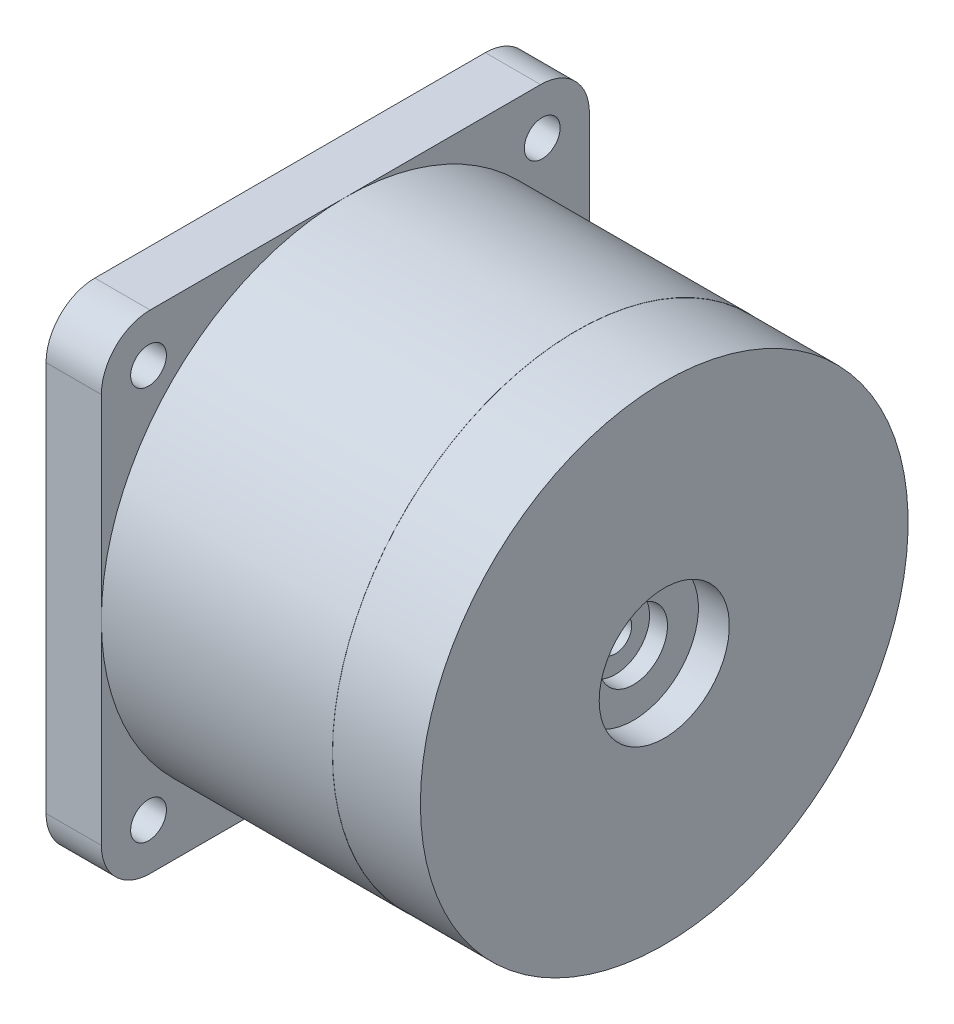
ISO-10303-21;
HEADER;
FILE_DESCRIPTION(('STEP AP214'),'2;1');
FILE_NAME('part.step','',(''),(''),'','','');
FILE_SCHEMA(('AUTOMOTIVE_DESIGN { 1 0 10303 214 1 1 1 1 }'));
ENDSEC;
DATA;
#1=APPLICATION_CONTEXT('core data for automotive mechanical design processes');
#2=APPLICATION_PROTOCOL_DEFINITION('international standard','automotive_design',2000,#1);
#3=PRODUCT_CONTEXT('',#1,'mechanical');
#4=PRODUCT('Part','Part','',(#3));
#5=PRODUCT_RELATED_PRODUCT_CATEGORY('part','',(#4));
#6=PRODUCT_DEFINITION_FORMATION('','',#4);
#7=PRODUCT_DEFINITION_CONTEXT('part definition',#1,'design');
#8=PRODUCT_DEFINITION('design','',#6,#7);
#9=PRODUCT_DEFINITION_SHAPE('','',#8);
#10=(LENGTH_UNIT() NAMED_UNIT(*) SI_UNIT(.MILLI.,.METRE.));
#11=(NAMED_UNIT(*) PLANE_ANGLE_UNIT() SI_UNIT($,.RADIAN.));
#12=(NAMED_UNIT(*) SI_UNIT($,.STERADIAN.) SOLID_ANGLE_UNIT());
#13=UNCERTAINTY_MEASURE_WITH_UNIT(LENGTH_MEASURE(1.E-05),#10,'distance_accuracy_value','');
#14=(GEOMETRIC_REPRESENTATION_CONTEXT(3) GLOBAL_UNCERTAINTY_ASSIGNED_CONTEXT((#13)) GLOBAL_UNIT_ASSIGNED_CONTEXT((#10,
#11,#12)) REPRESENTATION_CONTEXT('',''));
#15=CARTESIAN_POINT('',(0.,0.,0.));
#16=DIRECTION('',(0.,0.,1.));
#17=DIRECTION('',(1.,0.,0.));
#18=AXIS2_PLACEMENT_3D('',#15,#16,#17);
#19=CARTESIAN_POINT('',(0.,0.,0.));
#20=DIRECTION('',(-1.,0.,0.));
#21=DIRECTION('',(0.,0.,1.));
#22=AXIS2_PLACEMENT_3D('',#19,#20,#21);
#23=PLANE('',#22);
#24=CARTESIAN_POINT('',(0.,0.,0.));
#25=DIRECTION('',(-1.,0.,0.));
#26=DIRECTION('',(0.,0.,1.));
#27=AXIS2_PLACEMENT_3D('',#24,#25,#26);
#28=CIRCLE('',#27,14.99);
#29=CARTESIAN_POINT('',(0.,0.,14.99));
#30=VERTEX_POINT('',#29);
#31=EDGE_CURVE('E162',#30,#30,#28,.T.);
#32=ORIENTED_EDGE('',*,*,#31,.F.);
#33=EDGE_LOOP('',(#32));
#34=FACE_BOUND('',#33,.T.);
#35=CARTESIAN_POINT('',(0.,0.,0.));
#36=DIRECTION('',(-1.,0.,0.));
#37=DIRECTION('',(0.,0.,1.));
#38=AXIS2_PLACEMENT_3D('',#35,#36,#37);
#39=CIRCLE('',#38,4.);
#40=CARTESIAN_POINT('',(0.,0.,4.));
#41=VERTEX_POINT('',#40);
#42=EDGE_CURVE('E261',#41,#41,#39,.T.);
#43=ORIENTED_EDGE('',*,*,#42,.T.);
#44=EDGE_LOOP('',(#43));
#45=FACE_BOUND('',#44,.T.);
#46=ADVANCED_FACE('F34',(#34,#45),#23,.F.);
#47=CARTESIAN_POINT('',(-21.4,0.,0.));
#48=DIRECTION('',(-1.,0.,0.));
#49=DIRECTION('',(0.,0.,1.));
#50=AXIS2_PLACEMENT_3D('',#47,#48,#49);
#51=PLANE('',#50);
#52=CARTESIAN_POINT('',(-21.4,0.,0.));
#53=DIRECTION('',(-1.,0.,0.));
#54=DIRECTION('',(0.,0.,1.));
#55=AXIS2_PLACEMENT_3D('',#52,#53,#54);
#56=CIRCLE('',#55,13.5);
#57=CARTESIAN_POINT('',(-21.4,0.,13.5));
#58=VERTEX_POINT('',#57);
#59=EDGE_CURVE('E249',#58,#58,#56,.T.);
#60=ORIENTED_EDGE('',*,*,#59,.T.);
#61=EDGE_LOOP('',(#60));
#62=FACE_BOUND('',#61,.T.);
#63=CARTESIAN_POINT('',(-21.4,-4.9,0.));
#64=DIRECTION('',(-1.,0.,0.));
#65=DIRECTION('',(0.,0.,1.));
#66=AXIS2_PLACEMENT_3D('',#63,#64,#65);
#67=CIRCLE('',#66,5.);
#68=CARTESIAN_POINT('',(-21.4,-4.9,-5.));
#69=VERTEX_POINT('',#68);
#70=EDGE_CURVE('E258',#69,#69,#67,.T.);
#71=ORIENTED_EDGE('',*,*,#70,.F.);
#72=EDGE_LOOP('',(#71));
#73=FACE_BOUND('',#72,.T.);
#74=ADVANCED_FACE('F310',(#62,#73),#51,.T.);
#75=CARTESIAN_POINT('',(0.,0.,0.));
#76=DIRECTION('',(-1.,0.,0.));
#77=DIRECTION('',(0.,0.,1.));
#78=AXIS2_PLACEMENT_3D('',#75,#76,#77);
#79=CYLINDRICAL_SURFACE('',#78,14.99);
#80=CARTESIAN_POINT('',(-5.4,0.,0.));
#81=DIRECTION('',(-1.,0.,0.));
#82=DIRECTION('',(0.,0.,1.));
#83=AXIS2_PLACEMENT_3D('',#80,#81,#82);
#84=CIRCLE('',#83,14.99);
#85=CARTESIAN_POINT('',(-5.4,0.,14.99));
#86=VERTEX_POINT('',#85);
#87=EDGE_CURVE('E159',#86,#86,#84,.T.);
#88=ORIENTED_EDGE('',*,*,#87,.F.);
#89=EDGE_LOOP('',(#88));
#90=FACE_BOUND('',#89,.T.);
#91=ORIENTED_EDGE('',*,*,#31,.T.);
#92=EDGE_LOOP('',(#91));
#93=FACE_BOUND('',#92,.T.);
#94=ADVANCED_FACE('F312',(#90,#93),#79,.T.);
#95=CARTESIAN_POINT('',(-5.4,14.99,0.));
#96=DIRECTION('',(-1.,0.,0.));
#97=DIRECTION('',(0.,0.,1.));
#98=AXIS2_PLACEMENT_3D('',#95,#96,#97);
#99=PLANE('',#98);
#100=CARTESIAN_POINT('',(-5.4,0.,0.));
#101=DIRECTION('',(-1.,0.,0.));
#102=DIRECTION('',(0.,0.,1.));
#103=AXIS2_PLACEMENT_3D('',#100,#101,#102);
#104=CIRCLE('',#103,15.);
#105=CARTESIAN_POINT('',(-5.4,0.,15.));
#106=VERTEX_POINT('',#105);
#107=EDGE_CURVE('E140',#106,#106,#104,.T.);
#108=ORIENTED_EDGE('',*,*,#107,.F.);
#109=EDGE_LOOP('',(#108));
#110=FACE_BOUND('',#109,.T.);
#111=ORIENTED_EDGE('',*,*,#87,.T.);
#112=EDGE_LOOP('',(#111));
#113=FACE_BOUND('',#112,.T.);
#114=ADVANCED_FACE('F319',(#110,#113),#99,.F.);
#115=CARTESIAN_POINT('',(0.,0.,0.));
#116=DIRECTION('',(-1.,0.,0.));
#117=DIRECTION('',(0.,0.,1.));
#118=AXIS2_PLACEMENT_3D('',#115,#116,#117);
#119=CYLINDRICAL_SURFACE('',#118,15.);
#120=CARTESIAN_POINT('',(-19.6,0.,0.));
#121=DIRECTION('',(-1.,0.,0.));
#122=DIRECTION('',(0.,0.,1.));
#123=AXIS2_PLACEMENT_3D('',#120,#121,#122);
#124=CIRCLE('',#123,15.);
#125=CARTESIAN_POINT('',(-19.6,0.,15.));
#126=VERTEX_POINT('',#125);
#127=CARTESIAN_POINT('',(-19.6,15.,0.));
#128=VERTEX_POINT('',#127);
#129=EDGE_CURVE('E129',#126,#128,#124,.T.);
#130=ORIENTED_EDGE('',*,*,#129,.F.);
#131=CARTESIAN_POINT('',(-19.6,-15.,0.));
#132=VERTEX_POINT('',#131);
#133=EDGE_CURVE('E133',#132,#126,#124,.T.);
#134=ORIENTED_EDGE('',*,*,#133,.F.);
#135=CARTESIAN_POINT('',(-19.6,0.,-15.));
#136=VERTEX_POINT('',#135);
#137=EDGE_CURVE('E146',#136,#132,#124,.T.);
#138=ORIENTED_EDGE('',*,*,#137,.F.);
#139=EDGE_CURVE('E136',#128,#136,#124,.T.);
#140=ORIENTED_EDGE('',*,*,#139,.F.);
#141=EDGE_LOOP('',(#130,#134,#138,#140));
#142=FACE_BOUND('',#141,.T.);
#143=ORIENTED_EDGE('',*,*,#107,.T.);
#144=EDGE_LOOP('',(#143));
#145=FACE_BOUND('',#144,.T.);
#146=ADVANCED_FACE('F130',(#142,#145),#119,.T.);
#147=CARTESIAN_POINT('',(-19.6,-15.,-15.));
#148=DIRECTION('',(-1.,0.,0.));
#149=DIRECTION('',(0.,0.,1.));
#150=AXIS2_PLACEMENT_3D('',#147,#148,#149);
#151=PLANE('',#150);
#152=CARTESIAN_POINT('',(-19.6,12.1,12.1));
#153=DIRECTION('',(-1.,0.,0.));
#154=DIRECTION('',(0.,0.,1.));
#155=AXIS2_PLACEMENT_3D('',#152,#153,#154);
#156=CIRCLE('',#155,1.1);
#157=CARTESIAN_POINT('',(-19.6,12.1,13.2));
#158=VERTEX_POINT('',#157);
#159=EDGE_CURVE('E234',#158,#158,#156,.T.);
#160=ORIENTED_EDGE('',*,*,#159,.T.);
#161=EDGE_LOOP('',(#160));
#162=FACE_BOUND('',#161,.T.);
#163=DIRECTION('',(0.,0.,-1.));
#164=VECTOR('',#163,1.);
#165=CARTESIAN_POINT('',(-19.6,15.,-15.));
#166=LINE('',#165,#164);
#167=CARTESIAN_POINT('',(-19.6,15.,12.));
#168=VERTEX_POINT('',#167);
#169=EDGE_CURVE('E154',#168,#128,#166,.T.);
#170=ORIENTED_EDGE('',*,*,#169,.F.);
#171=CARTESIAN_POINT('',(-19.6,12.,12.));
#172=DIRECTION('',(-1.,0.,0.));
#173=DIRECTION('',(0.,0.,1.));
#174=AXIS2_PLACEMENT_3D('',#171,#172,#173);
#175=CIRCLE('',#174,3.);
#176=CARTESIAN_POINT('',(-19.6,12.,15.));
#177=VERTEX_POINT('',#176);
#178=EDGE_CURVE('E149',#168,#177,#175,.F.);
#179=ORIENTED_EDGE('',*,*,#178,.T.);
#180=DIRECTION('',(0.,1.,0.));
#181=VECTOR('',#180,1.);
#182=CARTESIAN_POINT('',(-19.6,15.,15.));
#183=LINE('',#182,#181);
#184=EDGE_CURVE('E116',#126,#177,#183,.T.);
#185=ORIENTED_EDGE('',*,*,#184,.F.);
#186=ORIENTED_EDGE('',*,*,#129,.T.);
#187=EDGE_LOOP('',(#170,#179,#185,#186));
#188=FACE_BOUND('',#187,.T.);
#189=ADVANCED_FACE('F148',(#162,#188),#151,.F.);
#190=CARTESIAN_POINT('',(-19.6,12.1,-12.1));
#191=DIRECTION('',(-1.,0.,0.));
#192=DIRECTION('',(0.,0.,1.));
#193=AXIS2_PLACEMENT_3D('',#190,#191,#192);
#194=CIRCLE('',#193,1.1);
#195=CARTESIAN_POINT('',(-19.6,12.1,-11.));
#196=VERTEX_POINT('',#195);
#197=EDGE_CURVE('E228',#196,#196,#194,.T.);
#198=ORIENTED_EDGE('',*,*,#197,.T.);
#199=EDGE_LOOP('',(#198));
#200=FACE_BOUND('',#199,.T.);
#201=DIRECTION('',(0.,-1.,0.));
#202=VECTOR('',#201,1.);
#203=CARTESIAN_POINT('',(-19.6,15.,-15.));
#204=LINE('',#203,#202);
#205=CARTESIAN_POINT('',(-19.6,12.,-15.));
#206=VERTEX_POINT('',#205);
#207=EDGE_CURVE('E217',#206,#136,#204,.T.);
#208=ORIENTED_EDGE('',*,*,#207,.F.);
#209=CARTESIAN_POINT('',(-19.6,12.,-12.));
#210=DIRECTION('',(-1.,0.,0.));
#211=DIRECTION('',(0.,0.,1.));
#212=AXIS2_PLACEMENT_3D('',#209,#210,#211);
#213=CIRCLE('',#212,3.);
#214=CARTESIAN_POINT('',(-19.6,15.,-12.));
#215=VERTEX_POINT('',#214);
#216=EDGE_CURVE('E11',#206,#215,#213,.F.);
#217=ORIENTED_EDGE('',*,*,#216,.T.);
#218=EDGE_CURVE('E123',#128,#215,#166,.T.);
#219=ORIENTED_EDGE('',*,*,#218,.F.);
#220=ORIENTED_EDGE('',*,*,#139,.T.);
#221=EDGE_LOOP('',(#208,#217,#219,#220));
#222=FACE_BOUND('',#221,.T.);
#223=ADVANCED_FACE('F216',(#200,#222),#151,.F.);
#224=CARTESIAN_POINT('',(-19.6,-12.1,-12.1));
#225=DIRECTION('',(-1.,0.,0.));
#226=DIRECTION('',(0.,0.,1.));
#227=AXIS2_PLACEMENT_3D('',#224,#225,#226);
#228=CIRCLE('',#227,1.1);
#229=CARTESIAN_POINT('',(-19.6,-12.1,-11.));
#230=VERTEX_POINT('',#229);
#231=EDGE_CURVE('E240',#230,#230,#228,.T.);
#232=ORIENTED_EDGE('',*,*,#231,.T.);
#233=EDGE_LOOP('',(#232));
#234=FACE_BOUND('',#233,.T.);
#235=DIRECTION('',(0.,0.,1.));
#236=VECTOR('',#235,1.);
#237=CARTESIAN_POINT('',(-19.6,-15.,-15.));
#238=LINE('',#237,#236);
#239=CARTESIAN_POINT('',(-19.6,-15.,-12.));
#240=VERTEX_POINT('',#239);
#241=EDGE_CURVE('E150',#240,#132,#238,.T.);
#242=ORIENTED_EDGE('',*,*,#241,.F.);
#243=CARTESIAN_POINT('',(-19.6,-12.,-12.));
#244=DIRECTION('',(-1.,0.,0.));
#245=DIRECTION('',(0.,0.,1.));
#246=AXIS2_PLACEMENT_3D('',#243,#244,#245);
#247=CIRCLE('',#246,3.);
#248=CARTESIAN_POINT('',(-19.6,-12.,-15.));
#249=VERTEX_POINT('',#248);
#250=EDGE_CURVE('E55',#240,#249,#247,.F.);
#251=ORIENTED_EDGE('',*,*,#250,.T.);
#252=EDGE_CURVE('E196',#136,#249,#204,.T.);
#253=ORIENTED_EDGE('',*,*,#252,.F.);
#254=ORIENTED_EDGE('',*,*,#137,.T.);
#255=EDGE_LOOP('',(#242,#251,#253,#254));
#256=FACE_BOUND('',#255,.T.);
#257=ADVANCED_FACE('F213',(#234,#256),#151,.F.);
#258=CARTESIAN_POINT('',(-19.6,-12.1,12.1));
#259=DIRECTION('',(-1.,0.,0.));
#260=DIRECTION('',(0.,0.,1.));
#261=AXIS2_PLACEMENT_3D('',#258,#259,#260);
#262=CIRCLE('',#261,1.1);
#263=CARTESIAN_POINT('',(-19.6,-12.1,13.2));
#264=VERTEX_POINT('',#263);
#265=EDGE_CURVE('E246',#264,#264,#262,.T.);
#266=ORIENTED_EDGE('',*,*,#265,.T.);
#267=EDGE_LOOP('',(#266));
#268=FACE_BOUND('',#267,.T.);
#269=CARTESIAN_POINT('',(-19.6,-12.,15.));
#270=VERTEX_POINT('',#269);
#271=EDGE_CURVE('E112',#270,#126,#183,.T.);
#272=ORIENTED_EDGE('',*,*,#271,.F.);
#273=CARTESIAN_POINT('',(-19.6,-12.,12.));
#274=DIRECTION('',(-1.,0.,0.));
#275=DIRECTION('',(0.,0.,1.));
#276=AXIS2_PLACEMENT_3D('',#273,#274,#275);
#277=CIRCLE('',#276,3.);
#278=CARTESIAN_POINT('',(-19.6,-15.,12.));
#279=VERTEX_POINT('',#278);
#280=EDGE_CURVE('E182',#270,#279,#277,.F.);
#281=ORIENTED_EDGE('',*,*,#280,.T.);
#282=EDGE_CURVE('E145',#132,#279,#238,.T.);
#283=ORIENTED_EDGE('',*,*,#282,.F.);
#284=ORIENTED_EDGE('',*,*,#133,.T.);
#285=EDGE_LOOP('',(#272,#281,#283,#284));
#286=FACE_BOUND('',#285,.T.);
#287=ADVANCED_FACE('F143',(#268,#286),#151,.F.);
#288=CARTESIAN_POINT('',(-23.,-15.,-15.));
#289=DIRECTION('',(-1.,0.,0.));
#290=DIRECTION('',(0.,0.,1.));
#291=AXIS2_PLACEMENT_3D('',#288,#289,#290);
#292=PLANE('',#291);
#293=CARTESIAN_POINT('',(-23.,0.,0.));
#294=DIRECTION('',(-1.,0.,0.));
#295=DIRECTION('',(0.,0.,1.));
#296=AXIS2_PLACEMENT_3D('',#293,#294,#295);
#297=CIRCLE('',#296,13.5);
#298=CARTESIAN_POINT('',(-23.,0.,13.5));
#299=VERTEX_POINT('',#298);
#300=EDGE_CURVE('E252',#299,#299,#297,.T.);
#301=ORIENTED_EDGE('',*,*,#300,.F.);
#302=EDGE_LOOP('',(#301));
#303=FACE_BOUND('',#302,.T.);
#304=CARTESIAN_POINT('',(-23.,-12.1,-12.1));
#305=DIRECTION('',(-1.,0.,0.));
#306=DIRECTION('',(0.,0.,1.));
#307=AXIS2_PLACEMENT_3D('',#304,#305,#306);
#308=CIRCLE('',#307,1.1);
#309=CARTESIAN_POINT('',(-23.,-12.1,-11.));
#310=VERTEX_POINT('',#309);
#311=EDGE_CURVE('E237',#310,#310,#308,.T.);
#312=ORIENTED_EDGE('',*,*,#311,.F.);
#313=EDGE_LOOP('',(#312));
#314=FACE_BOUND('',#313,.T.);
#315=CARTESIAN_POINT('',(-23.,12.1,-12.1));
#316=DIRECTION('',(-1.,0.,0.));
#317=DIRECTION('',(0.,0.,1.));
#318=AXIS2_PLACEMENT_3D('',#315,#316,#317);
#319=CIRCLE('',#318,1.1);
#320=CARTESIAN_POINT('',(-23.,12.1,-11.));
#321=VERTEX_POINT('',#320);
#322=EDGE_CURVE('E222',#321,#321,#319,.T.);
#323=ORIENTED_EDGE('',*,*,#322,.F.);
#324=EDGE_LOOP('',(#323));
#325=FACE_BOUND('',#324,.T.);
#326=DIRECTION('',(0.,1.,0.));
#327=VECTOR('',#326,1.);
#328=CARTESIAN_POINT('',(-23.,15.,15.));
#329=LINE('',#328,#327);
#330=CARTESIAN_POINT('',(-23.,-12.,15.));
#331=VERTEX_POINT('',#330);
#332=CARTESIAN_POINT('',(-23.,12.,15.));
#333=VERTEX_POINT('',#332);
#334=EDGE_CURVE('E225',#331,#333,#329,.T.);
#335=ORIENTED_EDGE('',*,*,#334,.T.);
#336=CARTESIAN_POINT('',(-23.,12.,12.));
#337=DIRECTION('',(-1.,0.,0.));
#338=DIRECTION('',(0.,0.,1.));
#339=AXIS2_PLACEMENT_3D('',#336,#337,#338);
#340=CIRCLE('',#339,3.);
#341=CARTESIAN_POINT('',(-23.,15.,12.));
#342=VERTEX_POINT('',#341);
#343=EDGE_CURVE('E180',#333,#342,#340,.T.);
#344=ORIENTED_EDGE('',*,*,#343,.T.);
#345=DIRECTION('',(0.,0.,-1.));
#346=VECTOR('',#345,1.);
#347=CARTESIAN_POINT('',(-23.,15.,-15.));
#348=LINE('',#347,#346);
#349=CARTESIAN_POINT('',(-23.,15.,-12.));
#350=VERTEX_POINT('',#349);
#351=EDGE_CURVE('E147',#342,#350,#348,.T.);
#352=ORIENTED_EDGE('',*,*,#351,.T.);
#353=CARTESIAN_POINT('',(-23.,12.,-12.));
#354=DIRECTION('',(-1.,0.,0.));
#355=DIRECTION('',(0.,0.,1.));
#356=AXIS2_PLACEMENT_3D('',#353,#354,#355);
#357=CIRCLE('',#356,3.);
#358=CARTESIAN_POINT('',(-23.,12.,-15.));
#359=VERTEX_POINT('',#358);
#360=EDGE_CURVE('E174',#350,#359,#357,.T.);
#361=ORIENTED_EDGE('',*,*,#360,.T.);
#362=DIRECTION('',(0.,-1.,0.));
#363=VECTOR('',#362,1.);
#364=CARTESIAN_POINT('',(-23.,15.,-15.));
#365=LINE('',#364,#363);
#366=CARTESIAN_POINT('',(-23.,-12.,-15.));
#367=VERTEX_POINT('',#366);
#368=EDGE_CURVE('E155',#359,#367,#365,.T.);
#369=ORIENTED_EDGE('',*,*,#368,.T.);
#370=CARTESIAN_POINT('',(-23.,-12.,-12.));
#371=DIRECTION('',(-1.,0.,0.));
#372=DIRECTION('',(0.,0.,1.));
#373=AXIS2_PLACEMENT_3D('',#370,#371,#372);
#374=CIRCLE('',#373,3.);
#375=CARTESIAN_POINT('',(-23.,-15.,-12.));
#376=VERTEX_POINT('',#375);
#377=EDGE_CURVE('E176',#367,#376,#374,.T.);
#378=ORIENTED_EDGE('',*,*,#377,.T.);
#379=DIRECTION('',(0.,0.,1.));
#380=VECTOR('',#379,1.);
#381=CARTESIAN_POINT('',(-23.,-15.,-15.));
#382=LINE('',#381,#380);
#383=CARTESIAN_POINT('',(-23.,-15.,12.));
#384=VERTEX_POINT('',#383);
#385=EDGE_CURVE('E207',#376,#384,#382,.T.);
#386=ORIENTED_EDGE('',*,*,#385,.T.);
#387=CARTESIAN_POINT('',(-23.,-12.,12.));
#388=DIRECTION('',(-1.,0.,0.));
#389=DIRECTION('',(0.,0.,1.));
#390=AXIS2_PLACEMENT_3D('',#387,#388,#389);
#391=CIRCLE('',#390,3.);
#392=EDGE_CURVE('E178',#384,#331,#391,.T.);
#393=ORIENTED_EDGE('',*,*,#392,.T.);
#394=EDGE_LOOP('',(#335,#344,#352,#361,#369,#378,#386,#393));
#395=FACE_BOUND('',#394,.T.);
#396=CARTESIAN_POINT('',(-23.,12.1,12.1));
#397=DIRECTION('',(-1.,0.,0.));
#398=DIRECTION('',(0.,0.,1.));
#399=AXIS2_PLACEMENT_3D('',#396,#397,#398);
#400=CIRCLE('',#399,1.1);
#401=CARTESIAN_POINT('',(-23.,12.1,13.2));
#402=VERTEX_POINT('',#401);
#403=EDGE_CURVE('E231',#402,#402,#400,.T.);
#404=ORIENTED_EDGE('',*,*,#403,.F.);
#405=EDGE_LOOP('',(#404));
#406=FACE_BOUND('',#405,.T.);
#407=CARTESIAN_POINT('',(-23.,-12.1,12.1));
#408=DIRECTION('',(-1.,0.,0.));
#409=DIRECTION('',(0.,0.,1.));
#410=AXIS2_PLACEMENT_3D('',#407,#408,#409);
#411=CIRCLE('',#410,1.1);
#412=CARTESIAN_POINT('',(-23.,-12.1,13.2));
#413=VERTEX_POINT('',#412);
#414=EDGE_CURVE('E243',#413,#413,#411,.T.);
#415=ORIENTED_EDGE('',*,*,#414,.F.);
#416=EDGE_LOOP('',(#415));
#417=FACE_BOUND('',#416,.T.);
#418=ADVANCED_FACE('F201',(#303,#314,#325,#395,#406,#417),#292,.T.);
#419=CARTESIAN_POINT('',(-23.,15.,-15.));
#420=DIRECTION('',(0.,0.,1.));
#421=DIRECTION('',(0.,-1.,0.));
#422=AXIS2_PLACEMENT_3D('',#419,#420,#421);
#423=PLANE('',#422);
#424=ORIENTED_EDGE('',*,*,#252,.T.);
#425=DIRECTION('',(1.,0.,0.));
#426=VECTOR('',#425,1.);
#427=CARTESIAN_POINT('',(-23.,-12.,-15.));
#428=LINE('',#427,#426);
#429=EDGE_CURVE('E42',#249,#367,#428,.F.);
#430=ORIENTED_EDGE('',*,*,#429,.T.);
#431=ORIENTED_EDGE('',*,*,#368,.F.);
#432=DIRECTION('',(1.,0.,0.));
#433=VECTOR('',#432,1.);
#434=CARTESIAN_POINT('',(-23.,12.,-15.));
#435=LINE('',#434,#433);
#436=EDGE_CURVE('E190',#359,#206,#435,.T.);
#437=ORIENTED_EDGE('',*,*,#436,.T.);
#438=ORIENTED_EDGE('',*,*,#207,.T.);
#439=EDGE_LOOP('',(#424,#430,#431,#437,#438));
#440=FACE_BOUND('',#439,.T.);
#441=ADVANCED_FACE('F195',(#440),#423,.F.);
#442=CARTESIAN_POINT('',(-23.,-15.,-15.));
#443=DIRECTION('',(0.,1.,0.));
#444=DIRECTION('',(0.,0.,1.));
#445=AXIS2_PLACEMENT_3D('',#442,#443,#444);
#446=PLANE('',#445);
#447=ORIENTED_EDGE('',*,*,#282,.T.);
#448=DIRECTION('',(1.,0.,0.));
#449=VECTOR('',#448,1.);
#450=CARTESIAN_POINT('',(-23.,-15.,12.));
#451=LINE('',#450,#449);
#452=EDGE_CURVE('E187',#279,#384,#451,.F.);
#453=ORIENTED_EDGE('',*,*,#452,.T.);
#454=ORIENTED_EDGE('',*,*,#385,.F.);
#455=DIRECTION('',(1.,0.,0.));
#456=VECTOR('',#455,1.);
#457=CARTESIAN_POINT('',(-23.,-15.,-12.));
#458=LINE('',#457,#456);
#459=EDGE_CURVE('E184',#376,#240,#458,.T.);
#460=ORIENTED_EDGE('',*,*,#459,.T.);
#461=ORIENTED_EDGE('',*,*,#241,.T.);
#462=EDGE_LOOP('',(#447,#453,#454,#460,#461));
#463=FACE_BOUND('',#462,.T.);
#464=ADVANCED_FACE('F212',(#463),#446,.F.);
#465=CARTESIAN_POINT('',(-23.,15.,15.));
#466=DIRECTION('',(0.,0.,-1.));
#467=DIRECTION('',(0.,1.,0.));
#468=AXIS2_PLACEMENT_3D('',#465,#466,#467);
#469=PLANE('',#468);
#470=ORIENTED_EDGE('',*,*,#184,.T.);
#471=DIRECTION('',(1.,0.,0.));
#472=VECTOR('',#471,1.);
#473=CARTESIAN_POINT('',(-23.,12.,15.));
#474=LINE('',#473,#472);
#475=EDGE_CURVE('E172',#177,#333,#474,.F.);
#476=ORIENTED_EDGE('',*,*,#475,.T.);
#477=ORIENTED_EDGE('',*,*,#334,.F.);
#478=DIRECTION('',(1.,0.,0.));
#479=VECTOR('',#478,1.);
#480=CARTESIAN_POINT('',(-23.,-12.,15.));
#481=LINE('',#480,#479);
#482=EDGE_CURVE('E120',#331,#270,#481,.T.);
#483=ORIENTED_EDGE('',*,*,#482,.T.);
#484=ORIENTED_EDGE('',*,*,#271,.T.);
#485=EDGE_LOOP('',(#470,#476,#477,#483,#484));
#486=FACE_BOUND('',#485,.T.);
#487=ADVANCED_FACE('F114',(#486),#469,.F.);
#488=CARTESIAN_POINT('',(-23.,15.,-15.));
#489=DIRECTION('',(0.,-1.,0.));
#490=DIRECTION('',(0.,0.,-1.));
#491=AXIS2_PLACEMENT_3D('',#488,#489,#490);
#492=PLANE('',#491);
#493=ORIENTED_EDGE('',*,*,#351,.F.);
#494=DIRECTION('',(1.,0.,0.));
#495=VECTOR('',#494,1.);
#496=CARTESIAN_POINT('',(-23.,15.,12.));
#497=LINE('',#496,#495);
#498=EDGE_CURVE('E167',#342,#168,#497,.T.);
#499=ORIENTED_EDGE('',*,*,#498,.T.);
#500=ORIENTED_EDGE('',*,*,#169,.T.);
#501=ORIENTED_EDGE('',*,*,#218,.T.);
#502=DIRECTION('',(1.,0.,0.));
#503=VECTOR('',#502,1.);
#504=CARTESIAN_POINT('',(-23.,15.,-12.));
#505=LINE('',#504,#503);
#506=EDGE_CURVE('E165',#215,#350,#505,.F.);
#507=ORIENTED_EDGE('',*,*,#506,.T.);
#508=EDGE_LOOP('',(#493,#499,#500,#501,#507));
#509=FACE_BOUND('',#508,.T.);
#510=ADVANCED_FACE('F221',(#509),#492,.F.);
#511=CARTESIAN_POINT('',(-23.,12.1,-12.1));
#512=DIRECTION('',(1.,0.,0.));
#513=DIRECTION('',(0.,0.,-1.));
#514=AXIS2_PLACEMENT_3D('',#511,#512,#513);
#515=CYLINDRICAL_SURFACE('',#514,1.1);
#516=ORIENTED_EDGE('',*,*,#322,.T.);
#517=EDGE_LOOP('',(#516));
#518=FACE_BOUND('',#517,.T.);
#519=ORIENTED_EDGE('',*,*,#197,.F.);
#520=EDGE_LOOP('',(#519));
#521=FACE_BOUND('',#520,.T.);
#522=ADVANCED_FACE('F341',(#518,#521),#515,.F.);
#523=CARTESIAN_POINT('',(-23.,12.1,12.1));
#524=DIRECTION('',(1.,0.,0.));
#525=DIRECTION('',(0.,0.,-1.));
#526=AXIS2_PLACEMENT_3D('',#523,#524,#525);
#527=CYLINDRICAL_SURFACE('',#526,1.1);
#528=ORIENTED_EDGE('',*,*,#403,.T.);
#529=EDGE_LOOP('',(#528));
#530=FACE_BOUND('',#529,.T.);
#531=ORIENTED_EDGE('',*,*,#159,.F.);
#532=EDGE_LOOP('',(#531));
#533=FACE_BOUND('',#532,.T.);
#534=ADVANCED_FACE('F337',(#530,#533),#527,.F.);
#535=CARTESIAN_POINT('',(-23.,-12.1,-12.1));
#536=DIRECTION('',(1.,0.,0.));
#537=DIRECTION('',(0.,0.,-1.));
#538=AXIS2_PLACEMENT_3D('',#535,#536,#537);
#539=CYLINDRICAL_SURFACE('',#538,1.1);
#540=ORIENTED_EDGE('',*,*,#311,.T.);
#541=EDGE_LOOP('',(#540));
#542=FACE_BOUND('',#541,.T.);
#543=ORIENTED_EDGE('',*,*,#231,.F.);
#544=EDGE_LOOP('',(#543));
#545=FACE_BOUND('',#544,.T.);
#546=ADVANCED_FACE('F333',(#542,#545),#539,.F.);
#547=CARTESIAN_POINT('',(-23.,-12.1,12.1));
#548=DIRECTION('',(1.,0.,0.));
#549=DIRECTION('',(0.,0.,-1.));
#550=AXIS2_PLACEMENT_3D('',#547,#548,#549);
#551=CYLINDRICAL_SURFACE('',#550,1.1);
#552=ORIENTED_EDGE('',*,*,#414,.T.);
#553=EDGE_LOOP('',(#552));
#554=FACE_BOUND('',#553,.T.);
#555=ORIENTED_EDGE('',*,*,#265,.F.);
#556=EDGE_LOOP('',(#555));
#557=FACE_BOUND('',#556,.T.);
#558=ADVANCED_FACE('F329',(#554,#557),#551,.F.);
#559=CARTESIAN_POINT('',(-21.4,0.,0.));
#560=DIRECTION('',(-1.,0.,0.));
#561=DIRECTION('',(0.,0.,1.));
#562=AXIS2_PLACEMENT_3D('',#559,#560,#561);
#563=CYLINDRICAL_SURFACE('',#562,13.5);
#564=ORIENTED_EDGE('',*,*,#59,.F.);
#565=EDGE_LOOP('',(#564));
#566=FACE_BOUND('',#565,.T.);
#567=ORIENTED_EDGE('',*,*,#300,.T.);
#568=EDGE_LOOP('',(#567));
#569=FACE_BOUND('',#568,.T.);
#570=ADVANCED_FACE('F325',(#566,#569),#563,.F.);
#571=CARTESIAN_POINT('',(-23.,12.,12.));
#572=DIRECTION('',(1.,0.,0.));
#573=DIRECTION('',(0.,0.,-1.));
#574=AXIS2_PLACEMENT_3D('',#571,#572,#573);
#575=CYLINDRICAL_SURFACE('',#574,3.);
#576=ORIENTED_EDGE('',*,*,#343,.F.);
#577=ORIENTED_EDGE('',*,*,#475,.F.);
#578=ORIENTED_EDGE('',*,*,#178,.F.);
#579=ORIENTED_EDGE('',*,*,#498,.F.);
#580=EDGE_LOOP('',(#576,#577,#578,#579));
#581=FACE_BOUND('',#580,.T.);
#582=ADVANCED_FACE('F328',(#581),#575,.T.);
#583=CARTESIAN_POINT('',(-23.,-12.,12.));
#584=DIRECTION('',(1.,0.,0.));
#585=DIRECTION('',(0.,0.,-1.));
#586=AXIS2_PLACEMENT_3D('',#583,#584,#585);
#587=CYLINDRICAL_SURFACE('',#586,3.);
#588=ORIENTED_EDGE('',*,*,#392,.F.);
#589=ORIENTED_EDGE('',*,*,#452,.F.);
#590=ORIENTED_EDGE('',*,*,#280,.F.);
#591=ORIENTED_EDGE('',*,*,#482,.F.);
#592=EDGE_LOOP('',(#588,#589,#590,#591));
#593=FACE_BOUND('',#592,.T.);
#594=ADVANCED_FACE('F367',(#593),#587,.T.);
#595=CARTESIAN_POINT('',(-23.,-12.,-12.));
#596=DIRECTION('',(1.,0.,0.));
#597=DIRECTION('',(0.,0.,-1.));
#598=AXIS2_PLACEMENT_3D('',#595,#596,#597);
#599=CYLINDRICAL_SURFACE('',#598,3.);
#600=ORIENTED_EDGE('',*,*,#377,.F.);
#601=ORIENTED_EDGE('',*,*,#429,.F.);
#602=ORIENTED_EDGE('',*,*,#250,.F.);
#603=ORIENTED_EDGE('',*,*,#459,.F.);
#604=EDGE_LOOP('',(#600,#601,#602,#603));
#605=FACE_BOUND('',#604,.T.);
#606=ADVANCED_FACE('F210',(#605),#599,.T.);
#607=CARTESIAN_POINT('',(-23.,12.,-12.));
#608=DIRECTION('',(1.,0.,0.));
#609=DIRECTION('',(0.,0.,-1.));
#610=AXIS2_PLACEMENT_3D('',#607,#608,#609);
#611=CYLINDRICAL_SURFACE('',#610,3.);
#612=ORIENTED_EDGE('',*,*,#360,.F.);
#613=ORIENTED_EDGE('',*,*,#506,.F.);
#614=ORIENTED_EDGE('',*,*,#216,.F.);
#615=ORIENTED_EDGE('',*,*,#436,.F.);
#616=EDGE_LOOP('',(#612,#613,#614,#615));
#617=FACE_BOUND('',#616,.T.);
#618=ADVANCED_FACE('F36',(#617),#611,.T.);
#619=CARTESIAN_POINT('',(-28.95,-4.9,0.));
#620=DIRECTION('',(1.,0.,0.));
#621=DIRECTION('',(0.,0.,-1.));
#622=AXIS2_PLACEMENT_3D('',#619,#620,#621);
#623=CYLINDRICAL_SURFACE('',#622,5.);
#624=CARTESIAN_POINT('',(-28.95,-4.9,0.));
#625=DIRECTION('',(-1.,0.,0.));
#626=DIRECTION('',(0.,0.,1.));
#627=AXIS2_PLACEMENT_3D('',#624,#625,#626);
#628=CIRCLE('',#627,5.);
#629=CARTESIAN_POINT('',(-28.95,-4.9,-5.));
#630=VERTEX_POINT('',#629);
#631=EDGE_CURVE('E255',#630,#630,#628,.T.);
#632=CARTESIAN_POINT('',(-28.95,-4.9,-5.));
#633=CARTESIAN_POINT('',(-28.8713541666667,-4.9,-5.));
#634=CARTESIAN_POINT('',(-28.7927083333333,-4.9,-5.));
#635=CARTESIAN_POINT('',(-28.6354166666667,-4.9,-5.));
#636=CARTESIAN_POINT('',(-28.5567708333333,-4.9,-5.));
#637=CARTESIAN_POINT('',(-28.3994791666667,-4.9,-5.));
#638=CARTESIAN_POINT('',(-28.3208333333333,-4.9,-5.));
#639=CARTESIAN_POINT('',(-28.1635416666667,-4.9,-5.));
#640=CARTESIAN_POINT('',(-28.0848958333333,-4.9,-5.));
#641=CARTESIAN_POINT('',(-27.9276041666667,-4.9,-5.));
#642=CARTESIAN_POINT('',(-27.8489583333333,-4.9,-5.));
#643=CARTESIAN_POINT('',(-27.6916666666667,-4.9,-5.));
#644=CARTESIAN_POINT('',(-27.6130208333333,-4.9,-5.));
#645=CARTESIAN_POINT('',(-27.4557291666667,-4.9,-5.));
#646=CARTESIAN_POINT('',(-27.3770833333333,-4.9,-5.));
#647=CARTESIAN_POINT('',(-27.2197916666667,-4.9,-5.));
#648=CARTESIAN_POINT('',(-27.1411458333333,-4.9,-5.));
#649=CARTESIAN_POINT('',(-26.9838541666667,-4.9,-5.));
#650=CARTESIAN_POINT('',(-26.9052083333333,-4.9,-5.));
#651=CARTESIAN_POINT('',(-26.7479166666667,-4.9,-5.));
#652=CARTESIAN_POINT('',(-26.6692708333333,-4.9,-5.));
#653=CARTESIAN_POINT('',(-26.5119791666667,-4.9,-5.));
#654=CARTESIAN_POINT('',(-26.4333333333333,-4.9,-5.));
#655=CARTESIAN_POINT('',(-26.2760416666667,-4.9,-5.));
#656=CARTESIAN_POINT('',(-26.1973958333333,-4.9,-5.));
#657=CARTESIAN_POINT('',(-26.0401041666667,-4.9,-5.));
#658=CARTESIAN_POINT('',(-25.9614583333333,-4.9,-5.));
#659=CARTESIAN_POINT('',(-25.8041666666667,-4.9,-5.));
#660=CARTESIAN_POINT('',(-25.7255208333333,-4.9,-5.));
#661=CARTESIAN_POINT('',(-25.5682291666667,-4.9,-5.));
#662=CARTESIAN_POINT('',(-25.4895833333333,-4.9,-5.));
#663=CARTESIAN_POINT('',(-25.3322916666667,-4.9,-5.));
#664=CARTESIAN_POINT('',(-25.2536458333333,-4.9,-5.));
#665=CARTESIAN_POINT('',(-25.0963541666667,-4.9,-5.));
#666=CARTESIAN_POINT('',(-25.0177083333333,-4.9,-5.));
#667=CARTESIAN_POINT('',(-24.8604166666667,-4.9,-5.));
#668=CARTESIAN_POINT('',(-24.7817708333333,-4.9,-5.));
#669=CARTESIAN_POINT('',(-24.6244791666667,-4.9,-5.));
#670=CARTESIAN_POINT('',(-24.5458333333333,-4.9,-5.));
#671=CARTESIAN_POINT('',(-24.3885416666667,-4.9,-5.));
#672=CARTESIAN_POINT('',(-24.3098958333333,-4.9,-5.));
#673=CARTESIAN_POINT('',(-24.1526041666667,-4.9,-5.));
#674=CARTESIAN_POINT('',(-24.0739583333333,-4.9,-5.));
#675=CARTESIAN_POINT('',(-23.9166666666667,-4.9,-5.));
#676=CARTESIAN_POINT('',(-23.8380208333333,-4.9,-5.));
#677=CARTESIAN_POINT('',(-23.6807291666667,-4.9,-5.));
#678=CARTESIAN_POINT('',(-23.6020833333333,-4.9,-5.));
#679=CARTESIAN_POINT('',(-23.4447916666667,-4.9,-5.));
#680=CARTESIAN_POINT('',(-23.3661458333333,-4.9,-5.));
#681=CARTESIAN_POINT('',(-23.2088541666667,-4.9,-5.));
#682=CARTESIAN_POINT('',(-23.1302083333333,-4.9,-5.));
#683=CARTESIAN_POINT('',(-22.9729166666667,-4.9,-5.));
#684=CARTESIAN_POINT('',(-22.8942708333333,-4.9,-5.));
#685=CARTESIAN_POINT('',(-22.7369791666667,-4.9,-5.));
#686=CARTESIAN_POINT('',(-22.6583333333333,-4.9,-5.));
#687=CARTESIAN_POINT('',(-22.5010416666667,-4.9,-5.));
#688=CARTESIAN_POINT('',(-22.4223958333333,-4.9,-5.));
#689=CARTESIAN_POINT('',(-22.2651041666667,-4.9,-5.));
#690=CARTESIAN_POINT('',(-22.1864583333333,-4.9,-5.));
#691=CARTESIAN_POINT('',(-22.0291666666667,-4.9,-5.));
#692=CARTESIAN_POINT('',(-21.9505208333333,-4.9,-5.));
#693=CARTESIAN_POINT('',(-21.7932291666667,-4.9,-5.));
#694=CARTESIAN_POINT('',(-21.7145833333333,-4.9,-5.));
#695=CARTESIAN_POINT('',(-21.5572916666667,-4.9,-5.));
#696=CARTESIAN_POINT('',(-21.4786458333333,-4.9,-5.));
#697=CARTESIAN_POINT('',(-21.4,-4.9,-5.));
#698=B_SPLINE_CURVE_WITH_KNOTS('',3,(#632,#633,#634,#635,#636,#637,#638,#639,#640,#641,#642,
#643,#644,#645,#646,#647,#648,#649,#650,#651,#652,#653,#654,#655,#656,#657,#658,#659,#660,#661,
#662,#663,#664,#665,#666,#667,#668,#669,#670,#671,#672,#673,#674,#675,#676,#677,#678,#679,#680,
#681,#682,#683,#684,#685,#686,#687,#688,#689,#690,#691,#692,#693,#694,#695,#696,#697),
.UNSPECIFIED.,.F.,.F.,(4,2,2,2,2,2,2,2,2,2,2,2,2,2,2,2,2,2,2,2,2,2,2,2,2,2,2,2,2,2,2,2,4),(0.,
0.235937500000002,0.471875,0.707812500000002,0.94375,1.1796875,1.415625,1.6515625,1.8875,
2.1234375,2.359375,2.5953125,2.83125,3.0671875,3.303125,3.5390625,3.775,4.0109375,4.246875,
4.4828125,4.71875,4.9546875,5.190625,5.4265625,5.6625,5.8984375,6.134375,6.3703125,6.60625,
6.8421875,7.078125,7.3140625,7.55),.UNSPECIFIED.);
#699=EDGE_CURVE('BSEAM301',#630,#69,#698,.T.);
#700=ORIENTED_EDGE('',*,*,#631,.F.);
#701=ORIENTED_EDGE('',*,*,#70,.T.);
#702=ORIENTED_EDGE('',*,*,#699,.T.);
#703=ORIENTED_EDGE('',*,*,#699,.F.);
#704=EDGE_LOOP('',(#700,#702,#701,#703));
#705=FACE_BOUND('',#704,.T.);
#706=ADVANCED_FACE('F301',(#705),#623,.T.);
#707=CARTESIAN_POINT('',(-28.95,-4.9,0.));
#708=DIRECTION('',(-1.,0.,0.));
#709=DIRECTION('',(0.,0.,1.));
#710=AXIS2_PLACEMENT_3D('',#707,#708,#709);
#711=PLANE('',#710);
#712=CARTESIAN_POINT('',(-28.95,-4.9,0.));
#713=DIRECTION('',(-1.,0.,0.));
#714=DIRECTION('',(0.,0.,1.));
#715=AXIS2_PLACEMENT_3D('',#712,#713,#714);
#716=CIRCLE('',#715,2.5);
#717=CARTESIAN_POINT('',(-28.95,-4.9,2.5));
#718=VERTEX_POINT('',#717);
#719=EDGE_CURVE('E282',#718,#718,#716,.T.);
#720=ORIENTED_EDGE('',*,*,#719,.F.);
#721=EDGE_LOOP('',(#720));
#722=FACE_BOUND('',#721,.T.);
#723=ORIENTED_EDGE('',*,*,#631,.T.);
#724=EDGE_LOOP('',(#723));
#725=FACE_BOUND('',#724,.T.);
#726=ADVANCED_FACE('F297',(#722,#725),#711,.T.);
#727=CARTESIAN_POINT('',(0.,0.,0.));
#728=DIRECTION('',(-1.,0.,0.));
#729=DIRECTION('',(0.,0.,1.));
#730=AXIS2_PLACEMENT_3D('',#727,#728,#729);
#731=CYLINDRICAL_SURFACE('',#730,4.);
#732=CARTESIAN_POINT('',(-1.9,0.,0.));
#733=DIRECTION('',(-1.,0.,0.));
#734=DIRECTION('',(0.,0.,1.));
#735=AXIS2_PLACEMENT_3D('',#732,#733,#734);
#736=CIRCLE('',#735,4.);
#737=CARTESIAN_POINT('',(-1.9,0.,4.));
#738=VERTEX_POINT('',#737);
#739=EDGE_CURVE('E266',#738,#738,#736,.T.);
#740=ORIENTED_EDGE('',*,*,#739,.T.);
#741=EDGE_LOOP('',(#740));
#742=FACE_BOUND('',#741,.T.);
#743=ORIENTED_EDGE('',*,*,#42,.F.);
#744=EDGE_LOOP('',(#743));
#745=FACE_BOUND('',#744,.T.);
#746=ADVANCED_FACE('F300',(#742,#745),#731,.F.);
#747=CARTESIAN_POINT('',(-1.9,4.,0.));
#748=DIRECTION('',(1.,0.,0.));
#749=DIRECTION('',(0.,0.,-1.));
#750=AXIS2_PLACEMENT_3D('',#747,#748,#749);
#751=PLANE('',#750);
#752=CARTESIAN_POINT('',(-1.9,0.,0.));
#753=DIRECTION('',(-1.,0.,0.));
#754=DIRECTION('',(0.,0.,1.));
#755=AXIS2_PLACEMENT_3D('',#752,#753,#754);
#756=CIRCLE('',#755,2.1);
#757=CARTESIAN_POINT('',(-1.9,0.,2.1));
#758=VERTEX_POINT('',#757);
#759=EDGE_CURVE('E269',#758,#758,#756,.T.);
#760=ORIENTED_EDGE('',*,*,#759,.T.);
#761=EDGE_LOOP('',(#760));
#762=FACE_BOUND('',#761,.T.);
#763=ORIENTED_EDGE('',*,*,#739,.F.);
#764=EDGE_LOOP('',(#763));
#765=FACE_BOUND('',#764,.T.);
#766=ADVANCED_FACE('F394',(#762,#765),#751,.T.);
#767=CARTESIAN_POINT('',(0.,0.,0.));
#768=DIRECTION('',(-1.,0.,0.));
#769=DIRECTION('',(0.,0.,1.));
#770=AXIS2_PLACEMENT_3D('',#767,#768,#769);
#771=CYLINDRICAL_SURFACE('',#770,2.1);
#772=CARTESIAN_POINT('',(-3.,0.,0.));
#773=DIRECTION('',(-1.,0.,0.));
#774=DIRECTION('',(0.,0.,1.));
#775=AXIS2_PLACEMENT_3D('',#772,#773,#774);
#776=CIRCLE('',#775,2.1);
#777=CARTESIAN_POINT('',(-3.,0.,2.1));
#778=VERTEX_POINT('',#777);
#779=EDGE_CURVE('E272',#778,#778,#776,.T.);
#780=ORIENTED_EDGE('',*,*,#779,.T.);
#781=EDGE_LOOP('',(#780));
#782=FACE_BOUND('',#781,.T.);
#783=ORIENTED_EDGE('',*,*,#759,.F.);
#784=EDGE_LOOP('',(#783));
#785=FACE_BOUND('',#784,.T.);
#786=ADVANCED_FACE('F402',(#782,#785),#771,.F.);
#787=CARTESIAN_POINT('',(-3.,2.1,0.));
#788=DIRECTION('',(1.,0.,0.));
#789=DIRECTION('',(0.,0.,-1.));
#790=AXIS2_PLACEMENT_3D('',#787,#788,#789);
#791=PLANE('',#790);
#792=CARTESIAN_POINT('',(-3.,0.,0.));
#793=DIRECTION('',(-1.,0.,0.));
#794=DIRECTION('',(0.,0.,1.));
#795=AXIS2_PLACEMENT_3D('',#792,#793,#794);
#796=CIRCLE('',#795,1.);
#797=CARTESIAN_POINT('',(-3.,0.,1.));
#798=VERTEX_POINT('',#797);
#799=EDGE_CURVE('E275',#798,#798,#796,.T.);
#800=ORIENTED_EDGE('',*,*,#799,.T.);
#801=EDGE_LOOP('',(#800));
#802=FACE_BOUND('',#801,.T.);
#803=ORIENTED_EDGE('',*,*,#779,.F.);
#804=EDGE_LOOP('',(#803));
#805=FACE_BOUND('',#804,.T.);
#806=ADVANCED_FACE('F410',(#802,#805),#791,.T.);
#807=CARTESIAN_POINT('',(0.,0.,0.));
#808=DIRECTION('',(-1.,0.,0.));
#809=DIRECTION('',(0.,0.,1.));
#810=AXIS2_PLACEMENT_3D('',#807,#808,#809);
#811=CYLINDRICAL_SURFACE('',#810,1.);
#812=CARTESIAN_POINT('',(-11.5,0.,0.));
#813=DIRECTION('',(-1.,0.,0.));
#814=DIRECTION('',(0.,0.,1.));
#815=AXIS2_PLACEMENT_3D('',#812,#813,#814);
#816=CIRCLE('',#815,0.999999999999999);
#817=CARTESIAN_POINT('',(-11.5,0.,0.999999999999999));
#818=VERTEX_POINT('',#817);
#819=EDGE_CURVE('E278',#818,#818,#816,.T.);
#820=ORIENTED_EDGE('',*,*,#819,.T.);
#821=EDGE_LOOP('',(#820));
#822=FACE_BOUND('',#821,.T.);
#823=ORIENTED_EDGE('',*,*,#799,.F.);
#824=EDGE_LOOP('',(#823));
#825=FACE_BOUND('',#824,.T.);
#826=ADVANCED_FACE('F418',(#822,#825),#811,.F.);
#827=CARTESIAN_POINT('',(-11.5,0.999999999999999,0.));
#828=DIRECTION('',(1.,0.,0.));
#829=DIRECTION('',(0.,0.,-1.));
#830=AXIS2_PLACEMENT_3D('',#827,#828,#829);
#831=PLANE('',#830);
#832=ORIENTED_EDGE('',*,*,#819,.F.);
#833=EDGE_LOOP('',(#832));
#834=FACE_BOUND('',#833,.T.);
#835=ADVANCED_FACE('F293',(#834),#831,.T.);
#836=CARTESIAN_POINT('',(-13.95,-4.9,0.));
#837=DIRECTION('',(-1.,0.,0.));
#838=DIRECTION('',(0.,0.,1.));
#839=AXIS2_PLACEMENT_3D('',#836,#837,#838);
#840=CYLINDRICAL_SURFACE('',#839,2.5);
#841=CARTESIAN_POINT('',(-13.95,-4.9,0.));
#842=DIRECTION('',(-1.,0.,0.));
#843=DIRECTION('',(0.,0.,1.));
#844=AXIS2_PLACEMENT_3D('',#841,#842,#843);
#845=CIRCLE('',#844,2.5);
#846=CARTESIAN_POINT('',(-13.95,-4.9,2.5));
#847=VERTEX_POINT('',#846);
#848=EDGE_CURVE('E281',#847,#847,#845,.T.);
#849=ORIENTED_EDGE('',*,*,#848,.F.);
#850=EDGE_LOOP('',(#849));
#851=FACE_BOUND('',#850,.T.);
#852=ORIENTED_EDGE('',*,*,#719,.T.);
#853=EDGE_LOOP('',(#852));
#854=FACE_BOUND('',#853,.T.);
#855=ADVANCED_FACE('F290',(#851,#854),#840,.F.);
#856=CARTESIAN_POINT('',(-13.95,-4.9,0.));
#857=DIRECTION('',(-1.,0.,0.));
#858=DIRECTION('',(0.,0.,1.));
#859=AXIS2_PLACEMENT_3D('',#856,#857,#858);
#860=PLANE('',#859);
#861=ORIENTED_EDGE('',*,*,#848,.T.);
#862=EDGE_LOOP('',(#861));
#863=FACE_BOUND('',#862,.T.);
#864=ADVANCED_FACE('F288',(#863),#860,.T.);
#865=CLOSED_SHELL('',(#46,#74,#94,#114,#146,#189,#223,#257,#287,#418,#441,#464,#487,#510,#522,
#534,#546,#558,#570,#582,#594,#606,#618,#706,#726,#746,#766,#786,#806,#826,#835,#855,#864));
#866=MANIFOLD_SOLID_BREP('B2',#865);
#867=ADVANCED_BREP_SHAPE_REPRESENTATION('',(#18,#866),#14);
#868=SHAPE_DEFINITION_REPRESENTATION(#9,#867);
ENDSEC;
END-ISO-10303-21;
